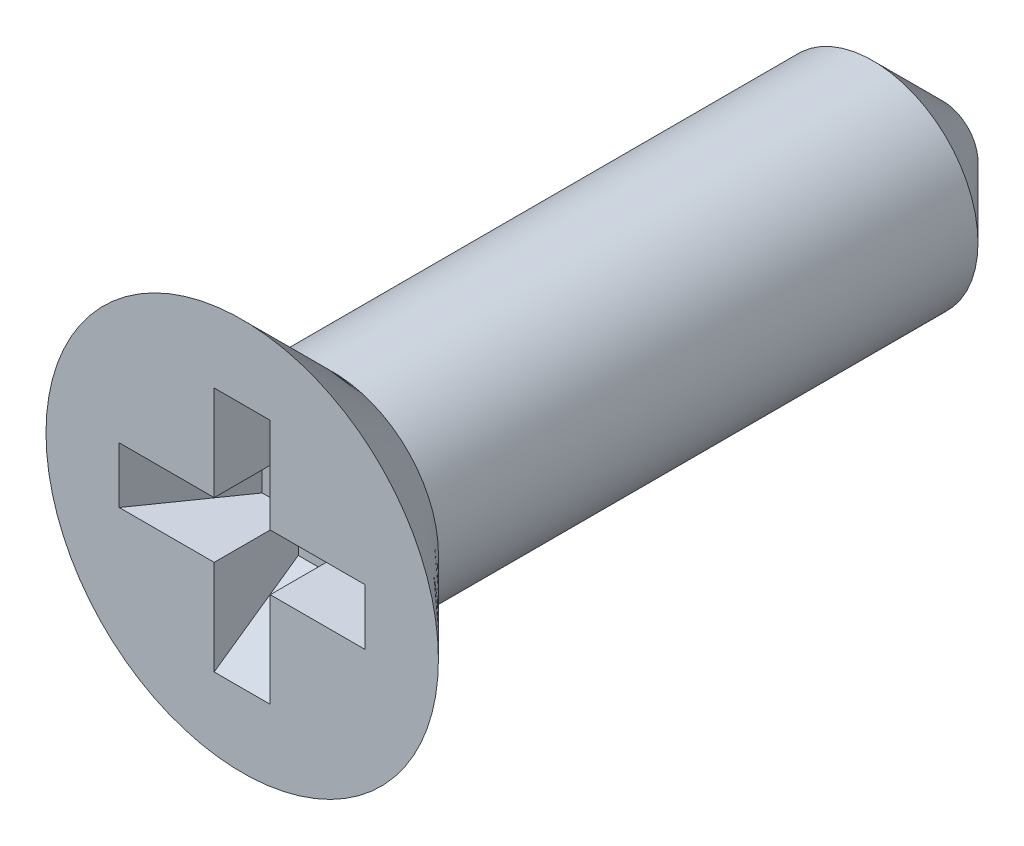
ISO-10303-21;
HEADER;
FILE_DESCRIPTION(('STEP AP214'),'2;1');
FILE_NAME('part.step','',(''),(''),'','','');
FILE_SCHEMA(('AUTOMOTIVE_DESIGN { 1 0 10303 214 1 1 1 1 }'));
ENDSEC;
DATA;
#1=APPLICATION_CONTEXT('core data for automotive mechanical design processes');
#2=APPLICATION_PROTOCOL_DEFINITION('international standard','automotive_design',2000,#1);
#3=PRODUCT_CONTEXT('',#1,'mechanical');
#4=PRODUCT('Part','Part','',(#3));
#5=PRODUCT_RELATED_PRODUCT_CATEGORY('part','',(#4));
#6=PRODUCT_DEFINITION_FORMATION('','',#4);
#7=PRODUCT_DEFINITION_CONTEXT('part definition',#1,'design');
#8=PRODUCT_DEFINITION('design','',#6,#7);
#9=PRODUCT_DEFINITION_SHAPE('','',#8);
#10=(LENGTH_UNIT() NAMED_UNIT(*) SI_UNIT(.MILLI.,.METRE.));
#11=(NAMED_UNIT(*) PLANE_ANGLE_UNIT() SI_UNIT($,.RADIAN.));
#12=(NAMED_UNIT(*) SI_UNIT($,.STERADIAN.) SOLID_ANGLE_UNIT());
#13=UNCERTAINTY_MEASURE_WITH_UNIT(LENGTH_MEASURE(1.E-05),#10,'distance_accuracy_value','');
#14=(GEOMETRIC_REPRESENTATION_CONTEXT(3) GLOBAL_UNCERTAINTY_ASSIGNED_CONTEXT((#13)) GLOBAL_UNIT_ASSIGNED_CONTEXT((#10,
#11,#12)) REPRESENTATION_CONTEXT('',''));
#15=CARTESIAN_POINT('',(0.,0.,0.));
#16=DIRECTION('',(0.,0.,1.));
#17=DIRECTION('',(1.,0.,0.));
#18=AXIS2_PLACEMENT_3D('',#15,#16,#17);
#19=CARTESIAN_POINT('',(-1.75499287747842,-0.4,0.));
#20=DIRECTION('',(0.819152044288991,0.,0.573576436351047));
#21=DIRECTION('',(0.573576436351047,0.,-0.819152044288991));
#22=AXIS2_PLACEMENT_3D('',#19,#20,#21);
#23=PLANE('',#22);
#24=DIRECTION('',(0.,1.,0.));
#25=VECTOR('',#24,1.);
#26=CARTESIAN_POINT('',(0.,0.4,-2.50638957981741));
#27=LINE('',#26,#25);
#28=CARTESIAN_POINT('',(0.,-0.29361042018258,-2.50638957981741));
#29=VERTEX_POINT('',#28);
#30=CARTESIAN_POINT('',(0.,0.,-2.50638957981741));
#31=VERTEX_POINT('',#30);
#32=EDGE_CURVE('E354',#29,#31,#27,.T.);
#33=ORIENTED_EDGE('',*,*,#32,.F.);
#34=CARTESIAN_POINT('',(0.103438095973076,-0.102874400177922,-2.65411449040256));
#35=CARTESIAN_POINT('',(0.09992365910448,-0.113485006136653,-2.64909535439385));
#36=CARTESIAN_POINT('',(0.096077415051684,-0.123726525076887,-2.64360234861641));
#37=CARTESIAN_POINT('',(0.0878958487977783,-0.143557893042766,-2.63191786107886));
#38=CARTESIAN_POINT('',(0.0835619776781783,-0.153149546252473,-2.62572845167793));
#39=CARTESIAN_POINT('',(0.0745900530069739,-0.171760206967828,-2.61291521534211));
#40=CARTESIAN_POINT('',(0.0699544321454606,-0.180782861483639,-2.60629486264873));
#41=CARTESIAN_POINT('',(0.0604348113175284,-0.198432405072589,-2.59269943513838));
#42=CARTESIAN_POINT('',(0.0555506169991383,-0.207058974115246,-2.58572408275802));
#43=CARTESIAN_POINT('',(0.0425194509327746,-0.229237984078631,-2.56711364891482));
#44=CARTESIAN_POINT('',(0.0342270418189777,-0.242528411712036,-2.55527086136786));
#45=CARTESIAN_POINT('',(0.0172728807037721,-0.268554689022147,-2.5310578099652));
#46=CARTESIAN_POINT('',(0.00860925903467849,-0.28128685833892,-2.51868487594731));
#47=CARTESIAN_POINT('',(-0.000140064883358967,-0.2938104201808,-2.50618954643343));
#48=B_SPLINE_CURVE_WITH_KNOTS('',3,(#34,#35,#36,#37,#38,#39,#40,#41,#42,#43,#44,#45,#46,#47),
.UNSPECIFIED.,.F.,.F.,(4,2,2,2,2,2,4),(0.,0.036695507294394,0.0732845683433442,
0.109608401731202,0.145961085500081,0.204852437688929,0.264086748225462),.UNSPECIFIED.);
#49=CARTESIAN_POINT('',(0.103298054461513,-0.103298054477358,-2.65391449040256));
#50=VERTEX_POINT('',#49);
#51=EDGE_CURVE('E289',#50,#29,#48,.T.);
#52=ORIENTED_EDGE('',*,*,#51,.F.);
#53=DIRECTION('',(-0.497542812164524,0.497542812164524,0.710564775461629));
#54=VECTOR('',#53,1.);
#55=CARTESIAN_POINT('',(-1.41956594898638,1.41956594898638,-0.479039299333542));
#56=LINE('',#55,#54);
#57=EDGE_CURVE('E352',#50,#31,#56,.T.);
#58=ORIENTED_EDGE('',*,*,#57,.T.);
#59=EDGE_LOOP('',(#33,#52,#58));
#60=FACE_BOUND('',#59,.T.);
#61=ADVANCED_FACE('F27',(#60),#23,.T.);
#62=DIRECTION('',(0.,1.,0.));
#63=VECTOR('',#62,1.);
#64=CARTESIAN_POINT('',(-0.91474383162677,-0.4,-1.2));
#65=LINE('',#64,#63);
#66=CARTESIAN_POINT('',(-0.91474383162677,0.4,-1.2));
#67=VERTEX_POINT('',#66);
#68=CARTESIAN_POINT('',(-0.91474383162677,-0.4,-1.2));
#69=VERTEX_POINT('',#68);
#70=EDGE_CURVE('E348',#67,#69,#65,.F.);
#71=ORIENTED_EDGE('',*,*,#70,.F.);
#72=DIRECTION('',(0.573576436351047,0.,-0.819152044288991));
#73=VECTOR('',#72,1.);
#74=CARTESIAN_POINT('',(-1.19117730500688,0.4,-0.8052120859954));
#75=LINE('',#74,#73);
#76=CARTESIAN_POINT('',(-1.75499287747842,0.4,0.));
#77=VERTEX_POINT('',#76);
#78=EDGE_CURVE('E232',#67,#77,#75,.F.);
#79=ORIENTED_EDGE('',*,*,#78,.T.);
#80=DIRECTION('',(0.,-1.,0.));
#81=VECTOR('',#80,1.);
#82=CARTESIAN_POINT('',(-1.75499287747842,-0.4,0.));
#83=LINE('',#82,#81);
#84=CARTESIAN_POINT('',(-1.75499287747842,-0.4,0.));
#85=VERTEX_POINT('',#84);
#86=EDGE_CURVE('E173',#77,#85,#83,.T.);
#87=ORIENTED_EDGE('',*,*,#86,.T.);
#88=DIRECTION('',(0.573576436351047,0.,-0.819152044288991));
#89=VECTOR('',#88,1.);
#90=CARTESIAN_POINT('',(-1.75499287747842,-0.4,0.));
#91=LINE('',#90,#89);
#92=EDGE_CURVE('E164',#69,#85,#91,.F.);
#93=ORIENTED_EDGE('',*,*,#92,.F.);
#94=EDGE_LOOP('',(#71,#79,#87,#93));
#95=FACE_BOUND('',#94,.T.);
#96=ADVANCED_FACE('F283',(#95),#23,.T.);
#97=CARTESIAN_POINT('',(0.4,-1.75499287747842,0.));
#98=DIRECTION('',(0.,0.819152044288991,0.573576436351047));
#99=DIRECTION('',(0.,-0.573576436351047,0.819152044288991));
#100=AXIS2_PLACEMENT_3D('',#97,#98,#99);
#101=PLANE('',#100);
#102=DIRECTION('',(-1.,0.,0.));
#103=VECTOR('',#102,1.);
#104=CARTESIAN_POINT('',(0.4,-0.91474383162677,-1.2));
#105=LINE('',#104,#103);
#106=CARTESIAN_POINT('',(-0.4,-0.91474383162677,-1.2));
#107=VERTEX_POINT('',#106);
#108=CARTESIAN_POINT('',(0.4,-0.91474383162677,-1.2));
#109=VERTEX_POINT('',#108);
#110=EDGE_CURVE('E346',#107,#109,#105,.F.);
#111=ORIENTED_EDGE('',*,*,#110,.F.);
#112=DIRECTION('',(0.,0.573576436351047,-0.819152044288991));
#113=VECTOR('',#112,1.);
#114=CARTESIAN_POINT('',(-0.4,-0.74539829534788,-1.44185049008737));
#115=LINE('',#114,#113);
#116=CARTESIAN_POINT('',(-0.4,-1.75499287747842,0.));
#117=VERTEX_POINT('',#116);
#118=EDGE_CURVE('E163',#107,#117,#115,.F.);
#119=ORIENTED_EDGE('',*,*,#118,.T.);
#120=DIRECTION('',(1.,0.,0.));
#121=VECTOR('',#120,1.);
#122=CARTESIAN_POINT('',(0.4,-1.75499287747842,0.));
#123=LINE('',#122,#121);
#124=CARTESIAN_POINT('',(0.4,-1.75499287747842,0.));
#125=VERTEX_POINT('',#124);
#126=EDGE_CURVE('E179',#117,#125,#123,.T.);
#127=ORIENTED_EDGE('',*,*,#126,.T.);
#128=DIRECTION('',(0.,0.573576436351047,-0.819152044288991));
#129=VECTOR('',#128,1.);
#130=CARTESIAN_POINT('',(0.4,-1.75499287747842,0.));
#131=LINE('',#130,#129);
#132=EDGE_CURVE('E240',#109,#125,#131,.F.);
#133=ORIENTED_EDGE('',*,*,#132,.F.);
#134=EDGE_LOOP('',(#111,#119,#127,#133));
#135=FACE_BOUND('',#134,.T.);
#136=ADVANCED_FACE('F279',(#135),#101,.T.);
#137=CARTESIAN_POINT('',(-1.75499287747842,1.75499287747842,-1.2));
#138=DIRECTION('',(0.,0.,-1.));
#139=DIRECTION('',(-1.,0.,0.));
#140=AXIS2_PLACEMENT_3D('',#137,#138,#139);
#141=PLANE('',#140);
#142=DIRECTION('',(0.,-1.,0.));
#143=VECTOR('',#142,1.);
#144=CARTESIAN_POINT('',(-0.4,1.75499287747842,-1.2));
#145=LINE('',#144,#143);
#146=CARTESIAN_POINT('',(-0.4,1.54919333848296,-1.2));
#147=VERTEX_POINT('',#146);
#148=CARTESIAN_POINT('',(-0.4,0.91474383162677,-1.2));
#149=VERTEX_POINT('',#148);
#150=EDGE_CURVE('E223',#147,#149,#145,.T.);
#151=ORIENTED_EDGE('',*,*,#150,.T.);
#152=CARTESIAN_POINT('',(-0.4,0.4,-1.2));
#153=VERTEX_POINT('',#152);
#154=EDGE_CURVE('E224',#149,#153,#145,.T.);
#155=ORIENTED_EDGE('',*,*,#154,.T.);
#156=DIRECTION('',(-1.,0.,0.));
#157=VECTOR('',#156,1.);
#158=CARTESIAN_POINT('',(-1.75499287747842,0.4,-1.2));
#159=LINE('',#158,#157);
#160=EDGE_CURVE('E227',#153,#67,#159,.T.);
#161=ORIENTED_EDGE('',*,*,#160,.T.);
#162=ORIENTED_EDGE('',*,*,#70,.T.);
#163=DIRECTION('',(1.,0.,0.));
#164=VECTOR('',#163,1.);
#165=CARTESIAN_POINT('',(-1.75499287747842,-0.4,-1.2));
#166=LINE('',#165,#164);
#167=CARTESIAN_POINT('',(-0.4,-0.4,-1.2));
#168=VERTEX_POINT('',#167);
#169=EDGE_CURVE('E208',#69,#168,#166,.T.);
#170=ORIENTED_EDGE('',*,*,#169,.T.);
#171=DIRECTION('',(0.,-1.,0.));
#172=VECTOR('',#171,1.);
#173=CARTESIAN_POINT('',(-0.4,-0.4,-1.2));
#174=LINE('',#173,#172);
#175=EDGE_CURVE('E159',#168,#107,#174,.T.);
#176=ORIENTED_EDGE('',*,*,#175,.T.);
#177=ORIENTED_EDGE('',*,*,#110,.T.);
#178=DIRECTION('',(0.,1.,0.));
#179=VECTOR('',#178,1.);
#180=CARTESIAN_POINT('',(0.4,-0.4,-1.2));
#181=LINE('',#180,#179);
#182=CARTESIAN_POINT('',(0.4,-0.4,-1.2));
#183=VERTEX_POINT('',#182);
#184=EDGE_CURVE('E211',#109,#183,#181,.T.);
#185=ORIENTED_EDGE('',*,*,#184,.T.);
#186=DIRECTION('',(1.,0.,0.));
#187=VECTOR('',#186,1.);
#188=CARTESIAN_POINT('',(0.4,-0.4,-1.2));
#189=LINE('',#188,#187);
#190=CARTESIAN_POINT('',(0.91474383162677,-0.4,-1.2));
#191=VERTEX_POINT('',#190);
#192=EDGE_CURVE('E214',#183,#191,#189,.T.);
#193=ORIENTED_EDGE('',*,*,#192,.T.);
#194=DIRECTION('',(0.,-1.,0.));
#195=VECTOR('',#194,1.);
#196=CARTESIAN_POINT('',(0.91474383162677,0.4,-1.2));
#197=LINE('',#196,#195);
#198=CARTESIAN_POINT('',(0.91474383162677,0.4,-1.2));
#199=VERTEX_POINT('',#198);
#200=EDGE_CURVE('E339',#191,#199,#197,.F.);
#201=ORIENTED_EDGE('',*,*,#200,.T.);
#202=DIRECTION('',(-1.,0.,0.));
#203=VECTOR('',#202,1.);
#204=CARTESIAN_POINT('',(0.4,0.4,-1.2));
#205=LINE('',#204,#203);
#206=CARTESIAN_POINT('',(0.4,0.4,-1.2));
#207=VERTEX_POINT('',#206);
#208=EDGE_CURVE('E217',#199,#207,#205,.T.);
#209=ORIENTED_EDGE('',*,*,#208,.T.);
#210=DIRECTION('',(0.,1.,0.));
#211=VECTOR('',#210,1.);
#212=CARTESIAN_POINT('',(0.4,1.75499287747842,-1.2));
#213=LINE('',#212,#211);
#214=CARTESIAN_POINT('',(0.4,0.91474383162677,-1.2));
#215=VERTEX_POINT('',#214);
#216=EDGE_CURVE('E220',#207,#215,#213,.T.);
#217=ORIENTED_EDGE('',*,*,#216,.T.);
#218=CARTESIAN_POINT('',(0.4,1.54919333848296,-1.2));
#219=VERTEX_POINT('',#218);
#220=EDGE_CURVE('E221',#215,#219,#213,.T.);
#221=ORIENTED_EDGE('',*,*,#220,.T.);
#222=CARTESIAN_POINT('',(0.,0.,-1.2));
#223=DIRECTION('',(0.,0.,-1.));
#224=DIRECTION('',(-1.,0.,0.));
#225=AXIS2_PLACEMENT_3D('',#222,#223,#224);
#226=CIRCLE('',#225,1.6);
#227=EDGE_CURVE('E249',#147,#219,#226,.T.);
#228=ORIENTED_EDGE('',*,*,#227,.F.);
#229=EDGE_LOOP('',(#151,#155,#161,#162,#170,#176,#177,#185,#193,#201,#209,#217,#221,#228));
#230=FACE_BOUND('',#229,.T.);
#231=ADVANCED_FACE('F282',(#230),#141,.F.);
#232=CARTESIAN_POINT('',(1.75499287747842,0.4,0.));
#233=DIRECTION('',(-0.819152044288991,0.,0.573576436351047));
#234=DIRECTION('',(0.573576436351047,0.,0.819152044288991));
#235=AXIS2_PLACEMENT_3D('',#232,#233,#234);
#236=PLANE('',#235);
#237=ORIENTED_EDGE('',*,*,#200,.F.);
#238=DIRECTION('',(-0.573576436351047,0.,-0.819152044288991));
#239=VECTOR('',#238,1.);
#240=CARTESIAN_POINT('',(0.74539829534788,-0.4,-1.44185049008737));
#241=LINE('',#240,#239);
#242=CARTESIAN_POINT('',(1.75499287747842,-0.4,0.));
#243=VERTEX_POINT('',#242);
#244=EDGE_CURVE('E239',#191,#243,#241,.F.);
#245=ORIENTED_EDGE('',*,*,#244,.T.);
#246=DIRECTION('',(0.,1.,0.));
#247=VECTOR('',#246,1.);
#248=CARTESIAN_POINT('',(1.75499287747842,0.4,0.));
#249=LINE('',#248,#247);
#250=CARTESIAN_POINT('',(1.75499287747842,0.4,0.));
#251=VERTEX_POINT('',#250);
#252=EDGE_CURVE('E190',#243,#251,#249,.T.);
#253=ORIENTED_EDGE('',*,*,#252,.T.);
#254=DIRECTION('',(-0.573576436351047,0.,-0.819152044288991));
#255=VECTOR('',#254,1.);
#256=CARTESIAN_POINT('',(1.75499287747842,0.4,0.));
#257=LINE('',#256,#255);
#258=EDGE_CURVE('E237',#199,#251,#257,.F.);
#259=ORIENTED_EDGE('',*,*,#258,.F.);
#260=EDGE_LOOP('',(#237,#245,#253,#259));
#261=FACE_BOUND('',#260,.T.);
#262=ADVANCED_FACE('F318',(#261),#236,.T.);
#263=CARTESIAN_POINT('',(-0.4,1.75499287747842,-1.2));
#264=DIRECTION('',(-1.,0.,0.));
#265=DIRECTION('',(0.,-1.,0.));
#266=AXIS2_PLACEMENT_3D('',#263,#264,#265);
#267=PLANE('',#266);
#268=DIRECTION('',(0.,-0.573576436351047,-0.819152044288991));
#269=VECTOR('',#268,1.);
#270=CARTESIAN_POINT('',(-0.4,1.75499287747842,0.));
#271=LINE('',#270,#269);
#272=CARTESIAN_POINT('',(-0.399999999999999,0.0800481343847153,-2.39206899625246));
#273=VERTEX_POINT('',#272);
#274=EDGE_CURVE('E233',#273,#149,#271,.F.);
#275=ORIENTED_EDGE('',*,*,#274,.T.);
#276=ORIENTED_EDGE('',*,*,#150,.F.);
#277=CARTESIAN_POINT('',(-0.399999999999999,15.0579581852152,12.2632700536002));
#278=CARTESIAN_POINT('',(-0.399999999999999,14.5558054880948,11.7612956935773));
#279=CARTESIAN_POINT('',(-0.399999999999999,14.0536451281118,11.2593289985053));
#280=CARTESIAN_POINT('',(-0.399999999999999,13.0492997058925,10.2554201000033));
#281=CARTESIAN_POINT('',(-0.399999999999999,12.5471146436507,9.75347789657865));
#282=CARTESIAN_POINT('',(-0.4,11.5427035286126,8.74962023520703));
#283=CARTESIAN_POINT('',(-0.4,11.0404774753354,8.24770477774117));
#284=CARTESIAN_POINT('',(-0.4,10.035974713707,7.24392476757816));
#285=CARTESIAN_POINT('',(-0.4,9.53369800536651,6.74206021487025));
#286=CARTESIAN_POINT('',(-0.4,8.53379190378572,5.74313239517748));
#287=CARTESIAN_POINT('',(-0.4,8.03616325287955,5.24606838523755));
#288=CARTESIAN_POINT('',(-0.4,7.04077073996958,4.25207516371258));
#289=CARTESIAN_POINT('',(-0.4,6.54300687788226,3.75514595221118));
#290=CARTESIAN_POINT('',(-0.4,5.54723950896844,2.76153914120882));
#291=CARTESIAN_POINT('',(-0.4,5.04923600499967,2.26486153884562));
#292=CARTESIAN_POINT('',(-0.4,4.30178667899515,1.52029138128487));
#293=CARTESIAN_POINT('',(-0.4,4.05256301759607,1.27217582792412));
#294=CARTESIAN_POINT('',(-0.4,3.55386033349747,0.776201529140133));
#295=CARTESIAN_POINT('',(-0.4,3.30438131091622,0.528342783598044));
#296=CARTESIAN_POINT('',(-0.4,2.93753545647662,0.164606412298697));
#297=CARTESIAN_POINT('',(-0.4,2.82036145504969,0.0485343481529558));
#298=CARTESIAN_POINT('',(-0.4,2.58585174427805,-0.183450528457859));
#299=CARTESIAN_POINT('',(-0.4,2.46851603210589,-0.299363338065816));
#300=CARTESIAN_POINT('',(-0.4,2.23338081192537,-0.531167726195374));
#301=CARTESIAN_POINT('',(-0.4,2.11558084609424,-0.647058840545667));
#302=CARTESIAN_POINT('',(-0.4,1.8796050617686,-0.878446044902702));
#303=CARTESIAN_POINT('',(-0.4,1.76142926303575,-0.993942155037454));
#304=CARTESIAN_POINT('',(-0.4,1.56017330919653,-1.18948487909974));
#305=CARTESIAN_POINT('',(-0.4,1.47726626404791,-1.26970931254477));
#306=CARTESIAN_POINT('',(-0.4,1.3109062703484,-1.42961730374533));
#307=CARTESIAN_POINT('',(-0.4,1.22745323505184,-1.5093007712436));
#308=CARTESIAN_POINT('',(-0.4,1.05990662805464,-1.66747507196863));
#309=CARTESIAN_POINT('',(-0.4,0.975815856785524,-1.74596884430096));
#310=CARTESIAN_POINT('',(-0.4,0.848350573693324,-1.8622334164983));
#311=CARTESIAN_POINT('',(-0.4,0.805646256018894,-1.9007373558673));
#312=CARTESIAN_POINT('',(-0.4,0.719561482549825,-1.97697966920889));
#313=CARTESIAN_POINT('',(-0.4,0.676181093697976,-2.01471811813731));
#314=CARTESIAN_POINT('',(-0.4,0.592876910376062,-2.08511456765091));
#315=CARTESIAN_POINT('',(-0.4,0.553057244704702,-2.11789551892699));
#316=CARTESIAN_POINT('',(-0.4,0.471811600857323,-2.18196758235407));
#317=CARTESIAN_POINT('',(-0.4,0.430377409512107,-2.21324856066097));
#318=CARTESIAN_POINT('',(-0.4,0.366190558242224,-2.25791062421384));
#319=CARTESIAN_POINT('',(-0.4,0.344296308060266,-2.27251479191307));
#320=CARTESIAN_POINT('',(-0.4,0.299692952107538,-2.30048853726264));
#321=CARTESIAN_POINT('',(-0.4,0.276983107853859,-2.31385695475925));
#322=CARTESIAN_POINT('',(-0.4,0.230746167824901,-2.33862577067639));
#323=CARTESIAN_POINT('',(-0.4,0.207227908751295,-2.35004229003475));
#324=CARTESIAN_POINT('',(-0.4,0.159057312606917,-2.37009132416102));
#325=CARTESIAN_POINT('',(-0.4,0.134407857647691,-2.37873050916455));
#326=CARTESIAN_POINT('',(-0.4,0.0836001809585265,-2.3920966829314));
#327=CARTESIAN_POINT('',(-0.4,0.0574247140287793,-2.39676217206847));
#328=CARTESIAN_POINT('',(-0.4,0.0047203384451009,-2.4008277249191));
#329=CARTESIAN_POINT('',(-0.4,-0.0218072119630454,-2.40024417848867));
#330=CARTESIAN_POINT('',(-0.4,-0.0740664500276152,-2.394031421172));
#331=CARTESIAN_POINT('',(-0.4,-0.0998019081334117,-2.38843198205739));
#332=CARTESIAN_POINT('',(-0.4,-0.137559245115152,-2.37718134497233));
#333=CARTESIAN_POINT('',(-0.4,-0.150037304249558,-2.37294020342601));
#334=CARTESIAN_POINT('',(-0.4,-0.174694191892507,-2.36366501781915));
#335=CARTESIAN_POINT('',(-0.4,-0.186873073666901,-2.35863111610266));
#336=CARTESIAN_POINT('',(-0.4,-0.221460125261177,-2.34323447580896));
#337=CARTESIAN_POINT('',(-0.4,-0.243504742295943,-2.33205986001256));
#338=CARTESIAN_POINT('',(-0.4,-0.28674808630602,-2.30816513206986));
#339=CARTESIAN_POINT('',(-0.4,-0.307945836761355,-2.2954433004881));
#340=CARTESIAN_POINT('',(-0.4,-0.370676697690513,-2.25562796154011));
#341=CARTESIAN_POINT('',(-0.4,-0.411199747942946,-2.22695881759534));
#342=CARTESIAN_POINT('',(-0.4,-0.491046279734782,-2.16720199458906));
#343=CARTESIAN_POINT('',(-0.4,-0.530352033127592,-2.13609149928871));
#344=CARTESIAN_POINT('',(-0.4,-0.607844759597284,-2.07268891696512));
#345=CARTESIAN_POINT('',(-0.4,-0.646034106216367,-2.04039972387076));
#346=CARTESIAN_POINT('',(-0.4,-0.720929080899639,-1.97574798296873));
#347=CARTESIAN_POINT('',(-0.4,-0.757648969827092,-1.94340180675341));
#348=CARTESIAN_POINT('',(-0.4,-0.830642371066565,-1.8782086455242));
#349=CARTESIAN_POINT('',(-0.4,-0.866915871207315,-1.84536164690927));
#350=CARTESIAN_POINT('',(-0.4,-0.97527461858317,-1.74629556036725));
#351=CARTESIAN_POINT('',(-0.4,-1.04688735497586,-1.67956084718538));
#352=CARTESIAN_POINT('',(-0.4,-1.1894988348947,-1.54527111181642));
#353=CARTESIAN_POINT('',(-0.4,-1.26049672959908,-1.47771519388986));
#354=CARTESIAN_POINT('',(-0.4,-1.40204788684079,-1.34215102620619));
#355=CARTESIAN_POINT('',(-0.4,-1.47260118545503,-1.27414281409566));
#356=CARTESIAN_POINT('',(-0.4,-1.61263010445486,-1.1385931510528));
#357=CARTESIAN_POINT('',(-0.4,-1.68210893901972,-1.07105501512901));
#358=CARTESIAN_POINT('',(-0.4,-1.82087103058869,-0.935775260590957));
#359=CARTESIAN_POINT('',(-0.4,-1.89015428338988,-0.868033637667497));
#360=CARTESIAN_POINT('',(-0.4,-2.09772182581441,-0.664662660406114));
#361=CARTESIAN_POINT('',(-0.4,-2.23579508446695,-0.528818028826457));
#362=CARTESIAN_POINT('',(-0.4,-2.64691525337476,-0.123422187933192));
#363=CARTESIAN_POINT('',(-0.4,-2.9195143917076,0.146582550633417));
#364=CARTESIAN_POINT('',(-0.4,-3.46422315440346,0.687087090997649));
#365=CARTESIAN_POINT('',(-0.4,-3.73633277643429,0.957586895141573));
#366=CARTESIAN_POINT('',(-0.4,-4.28035165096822,1.4989153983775));
#367=CARTESIAN_POINT('',(-0.4,-4.55226084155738,1.76974415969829));
#368=CARTESIAN_POINT('',(-0.4,-5.09592685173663,2.31155357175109));
#369=CARTESIAN_POINT('',(-0.4,-5.3676836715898,2.58253422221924));
#370=CARTESIAN_POINT('',(-0.4,-6.19795427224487,3.41071951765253));
#371=CARTESIAN_POINT('',(-0.4,-6.75631703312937,3.96807555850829));
#372=CARTESIAN_POINT('',(-0.4,-7.59365945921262,4.80417361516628));
#373=CARTESIAN_POINT('',(-0.4,-7.87270550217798,5.08284918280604));
#374=CARTESIAN_POINT('',(-0.4,-8.43076267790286,5.64023492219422));
#375=CARTESIAN_POINT('',(-0.4,-8.70977381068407,5.91894509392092));
#376=CARTESIAN_POINT('',(-0.4,-8.98877231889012,6.19766790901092));
#377=B_SPLINE_CURVE_WITH_KNOTS('',3,(#277,#278,#279,#280,#281,#282,#283,#284,#285,#286,#287,
#288,#289,#290,#291,#292,#293,#294,#295,#296,#297,#298,#299,#300,#301,#302,#303,#304,#305,#306,
#307,#308,#309,#310,#311,#312,#313,#314,#315,#316,#317,#318,#319,#320,#321,#322,#323,#324,#325,
#326,#327,#328,#329,#330,#331,#332,#333,#334,#335,#336,#337,#338,#339,#340,#341,#342,#343,#344,
#345,#346,#347,#348,#349,#350,#351,#352,#353,#354,#355,#356,#357,#358,#359,#360,#361,#362,#363,
#364,#365,#366,#367,#368,#369,#370,#371,#372,#373,#374,#375,#376),.UNSPECIFIED.,.F.,.F.,(4,2,2,
2,2,2,2,2,2,2,2,2,2,2,2,2,2,2,2,2,2,2,2,2,2,2,2,2,2,2,2,2,2,2,2,2,2,2,2,2,2,2,2,2,2,2,2,2,2,4),
(0.,2.13007518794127,4.26015084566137,6.39025675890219,8.5203622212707,10.630424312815,
12.7404877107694,14.8505265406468,15.905544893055,16.9605627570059,17.4553578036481,
17.9501616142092,18.4459113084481,18.9416353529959,19.2877342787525,19.6338895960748,
19.9789680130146,20.1514624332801,20.3239398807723,20.4786541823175,20.6342979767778,
20.7132243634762,20.7922241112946,20.8705360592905,20.9486584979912,21.0279691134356,
21.1070321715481,21.1856290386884,21.2251461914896,21.2646562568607,21.3387009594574,
21.412828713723,21.5615772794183,21.7119356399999,21.8619468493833,22.0087463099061,
22.1555497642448,22.4491996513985,22.7432052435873,23.0371866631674,23.3278722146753,
23.6185639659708,24.1996497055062,25.3506976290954,26.5017510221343,27.6530742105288,
28.8043954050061,31.1711932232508,32.3542996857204,33.5374054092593),.UNSPECIFIED.);
#378=CARTESIAN_POINT('',(-0.4,1.4456832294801,-1.3));
#379=VERTEX_POINT('',#378);
#380=EDGE_CURVE('E266',#379,#147,#377,.F.);
#381=ORIENTED_EDGE('',*,*,#380,.F.);
#382=EDGE_CURVE('E333',#273,#379,#377,.F.);
#383=ORIENTED_EDGE('',*,*,#382,.F.);
#384=EDGE_LOOP('',(#275,#276,#381,#383));
#385=FACE_BOUND('',#384,.T.);
#386=ADVANCED_FACE('F329',(#385),#267,.T.);
#387=CARTESIAN_POINT('',(0.4,1.75499287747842,-1.2));
#388=DIRECTION('',(1.,0.,0.));
#389=DIRECTION('',(0.,0.,-1.));
#390=AXIS2_PLACEMENT_3D('',#387,#388,#389);
#391=PLANE('',#390);
#392=ORIENTED_EDGE('',*,*,#220,.F.);
#393=DIRECTION('',(0.,-0.573576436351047,-0.819152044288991));
#394=VECTOR('',#393,1.);
#395=CARTESIAN_POINT('',(0.4,1.19117730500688,-0.8052120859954));
#396=LINE('',#395,#394);
#397=CARTESIAN_POINT('',(0.4,0.080048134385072,-2.39206899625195));
#398=VERTEX_POINT('',#397);
#399=EDGE_CURVE('E236',#398,#215,#396,.F.);
#400=ORIENTED_EDGE('',*,*,#399,.F.);
#401=CARTESIAN_POINT('',(0.4,-8.98877231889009,6.19766790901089));
#402=CARTESIAN_POINT('',(0.4,-8.67677785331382,5.88598452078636));
#403=CARTESIAN_POINT('',(0.4,-8.36476980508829,5.57431472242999));
#404=CARTESIAN_POINT('',(0.4,-7.74070720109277,4.95101906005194));
#405=CARTESIAN_POINT('',(0.4,-7.42865264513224,4.63939319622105));
#406=CARTESIAN_POINT('',(0.4,-6.80445030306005,4.01617482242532));
#407=CARTESIAN_POINT('',(0.4,-6.49230251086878,3.70458231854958));
#408=CARTESIAN_POINT('',(0.4,-5.86791216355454,3.08149481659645));
#409=CARTESIAN_POINT('',(0.4,-5.55566960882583,2.76999981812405));
#410=CARTESIAN_POINT('',(0.4,-4.93358205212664,2.14971502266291));
#411=CARTESIAN_POINT('',(0.4,-4.6237383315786,1.84092394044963));
#412=CARTESIAN_POINT('',(0.4,-4.00378028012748,1.22360590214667));
#413=CARTESIAN_POINT('',(0.4,-3.69366594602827,0.915078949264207));
#414=CARTESIAN_POINT('',(0.4,-3.2280826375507,0.452721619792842));
#415=CARTESIAN_POINT('',(0.4,-3.07282418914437,0.298679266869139));
#416=CARTESIAN_POINT('',(0.4,-2.76208514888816,-0.00918294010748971));
#417=CARTESIAN_POINT('',(0.4,-2.60660455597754,-0.163002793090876));
#418=CARTESIAN_POINT('',(0.4,-2.2952766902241,-0.47026389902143));
#419=CARTESIAN_POINT('',(0.4,-2.13942942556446,-0.623705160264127));
#420=CARTESIAN_POINT('',(0.4,-1.82707739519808,-0.929916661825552));
#421=CARTESIAN_POINT('',(0.4,-1.67057263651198,-1.08268690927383));
#422=CARTESIAN_POINT('',(0.4,-1.4712876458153,-1.27534266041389));
#423=CARTESIAN_POINT('',(0.4,-1.42919052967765,-1.31593419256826));
#424=CARTESIAN_POINT('',(0.4,-1.34485413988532,-1.39696971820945));
#425=CARTESIAN_POINT('',(0.4,-1.30261486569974,-1.43741371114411));
#426=CARTESIAN_POINT('',(0.4,-1.21790078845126,-1.51815834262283));
#427=CARTESIAN_POINT('',(0.4,-1.17542576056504,-1.5584587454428));
#428=CARTESIAN_POINT('',(0.4,-1.09022739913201,-1.63879610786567));
#429=CARTESIAN_POINT('',(0.4,-1.04750406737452,-1.67883306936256));
#430=CARTESIAN_POINT('',(0.4,-0.946477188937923,-1.77269586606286));
#431=CARTESIAN_POINT('',(0.4,-0.888030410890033,-1.82636758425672));
#432=CARTESIAN_POINT('',(0.4,-0.770250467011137,-1.93246551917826));
#433=CARTESIAN_POINT('',(0.4,-0.710919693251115,-1.98489435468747));
#434=CARTESIAN_POINT('',(0.4,-0.609163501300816,-2.07156587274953));
#435=CARTESIAN_POINT('',(0.4,-0.567230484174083,-2.10638522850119));
#436=CARTESIAN_POINT('',(0.4,-0.481616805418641,-2.17449372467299));
#437=CARTESIAN_POINT('',(0.4,-0.437925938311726,-2.20777040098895));
#438=CARTESIAN_POINT('',(0.4,-0.370106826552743,-2.25527989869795));
#439=CARTESIAN_POINT('',(0.4,-0.346914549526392,-2.2708361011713));
#440=CARTESIAN_POINT('',(0.4,-0.299611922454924,-2.30057434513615));
#441=CARTESIAN_POINT('',(0.4,-0.275500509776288,-2.31475472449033));
#442=CARTESIAN_POINT('',(0.4,-0.226415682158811,-2.34083021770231));
#443=CARTESIAN_POINT('',(0.4,-0.201456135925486,-2.35275078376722));
#444=CARTESIAN_POINT('',(0.4,-0.150247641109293,-2.37335246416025));
#445=CARTESIAN_POINT('',(0.4,-0.124002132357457,-2.3820417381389));
#446=CARTESIAN_POINT('',(0.4,-0.0712736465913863,-2.39447099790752));
#447=CARTESIAN_POINT('',(0.4,-0.0448320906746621,-2.39837555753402));
#448=CARTESIAN_POINT('',(0.4,0.00826983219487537,-2.40078938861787));
#449=CARTESIAN_POINT('',(0.4,0.0349297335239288,-2.39930811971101));
#450=CARTESIAN_POINT('',(0.4,0.0872151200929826,-2.39142094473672));
#451=CARTESIAN_POINT('',(0.4,0.112847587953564,-2.38505800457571));
#452=CARTESIAN_POINT('',(0.4,0.162996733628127,-2.36872094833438));
#453=CARTESIAN_POINT('',(0.4,0.187507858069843,-2.35873067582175));
#454=CARTESIAN_POINT('',(0.4,0.250211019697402,-2.32944881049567));
#455=CARTESIAN_POINT('',(0.4,0.287474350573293,-2.30822859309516));
#456=CARTESIAN_POINT('',(0.4,0.36001468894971,-2.26257652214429));
#457=CARTESIAN_POINT('',(0.4,0.395285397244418,-2.23813521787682));
#458=CARTESIAN_POINT('',(0.4,0.464698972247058,-2.18731247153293));
#459=CARTESIAN_POINT('',(0.4,0.498834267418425,-2.16092076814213));
#460=CARTESIAN_POINT('',(0.4,0.566167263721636,-2.10707763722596));
#461=CARTESIAN_POINT('',(0.4,0.599366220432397,-2.07962775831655));
#462=CARTESIAN_POINT('',(0.4,0.688211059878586,-2.00455725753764));
#463=CARTESIAN_POINT('',(0.4,0.743294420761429,-1.95627354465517));
#464=CARTESIAN_POINT('',(0.4,0.852521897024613,-1.85861308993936));
#465=CARTESIAN_POINT('',(0.4,0.906665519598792,-1.80923580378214));
#466=CARTESIAN_POINT('',(0.4,1.0141200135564,-1.71003906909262));
#467=CARTESIAN_POINT('',(0.4,1.06743344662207,-1.66022239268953));
#468=CARTESIAN_POINT('',(0.4,1.17366653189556,-1.56017068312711));
#469=CARTESIAN_POINT('',(0.4,1.22658617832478,-1.50993564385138));
#470=CARTESIAN_POINT('',(0.4,1.34022302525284,-1.40147670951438));
#471=CARTESIAN_POINT('',(0.4,1.40089527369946,-1.34320575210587));
#472=CARTESIAN_POINT('',(0.4,1.52204643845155,-1.22635067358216));
#473=CARTESIAN_POINT('',(0.4,1.58252512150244,-1.16776631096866));
#474=CARTESIAN_POINT('',(0.4,1.76134257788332,-0.994028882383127));
#475=CARTESIAN_POINT('',(0.4,1.87943072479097,-0.878617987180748));
#476=CARTESIAN_POINT('',(0.4,2.11522557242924,-0.647406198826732));
#477=CARTESIAN_POINT('',(0.4,2.2329322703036,-0.531605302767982));
#478=CARTESIAN_POINT('',(0.4,2.58561472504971,-0.18393263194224));
#479=CARTESIAN_POINT('',(0.4,2.82024009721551,0.0482944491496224));
#480=CARTESIAN_POINT('',(0.4,3.26821543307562,0.492493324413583));
#481=CARTESIAN_POINT('',(0.4,3.48160116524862,0.704429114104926));
#482=CARTESIAN_POINT('',(0.4,3.90816301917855,1.12851207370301));
#483=CARTESIAN_POINT('',(0.4,4.12133914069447,1.34065924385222));
#484=CARTESIAN_POINT('',(0.4,4.76075243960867,1.97736484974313));
#485=CARTESIAN_POINT('',(0.4,5.18680015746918,2.40211347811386));
#486=CARTESIAN_POINT('',(0.4,6.40063874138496,3.61287974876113));
#487=CARTESIAN_POINT('',(0.4,7.18816227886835,4.39916530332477));
#488=CARTESIAN_POINT('',(0.4,8.76295040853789,5.97199608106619));
#489=CARTESIAN_POINT('',(0.4,9.55021500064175,6.75854130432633));
#490=CARTESIAN_POINT('',(0.4,11.1242654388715,8.33141136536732));
#491=CARTESIAN_POINT('',(0.4,11.9110513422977,9.1177361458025));
#492=CARTESIAN_POINT('',(0.4,13.4845477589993,10.6904604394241));
#493=CARTESIAN_POINT('',(0.4,14.2712582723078,11.4768599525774));
#494=CARTESIAN_POINT('',(0.4,15.0579581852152,12.2632700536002));
#495=B_SPLINE_CURVE_WITH_KNOTS('',3,(#401,#402,#403,#404,#405,#406,#407,#408,#409,#410,#411,
#412,#413,#414,#415,#416,#417,#418,#419,#420,#421,#422,#423,#424,#425,#426,#427,#428,#429,#430,
#431,#432,#433,#434,#435,#436,#437,#438,#439,#440,#441,#442,#443,#444,#445,#446,#447,#448,#449,
#450,#451,#452,#453,#454,#455,#456,#457,#458,#459,#460,#461,#462,#463,#464,#465,#466,#467,#468,
#469,#470,#471,#472,#473,#474,#475,#476,#477,#478,#479,#480,#481,#482,#483,#484,#485,#486,#487,
#488,#489,#490,#491,#492,#493,#494),.UNSPECIFIED.,.F.,.F.,(4,2,2,2,2,2,2,2,2,2,2,2,2,2,2,2,2,2,
2,2,2,2,2,2,2,2,2,2,2,2,2,2,2,2,2,2,2,2,2,2,2,2,2,2,2,2,4),(0.,1.3230206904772,2.64604695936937,
3.96920045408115,5.29234851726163,6.60467298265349,7.91701316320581,8.57314423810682,
9.22927845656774,9.88539816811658,10.5415108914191,10.7169488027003,10.8923873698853,
11.0680404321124,11.2436922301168,11.4817424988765,11.7192361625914,11.8827337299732,
12.0473795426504,12.1311266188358,12.2149736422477,12.2978114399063,12.3804386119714,
12.4601358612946,12.5396931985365,12.6185582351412,12.6977789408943,12.8260633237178,
12.9547328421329,13.0841355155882,13.2133555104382,13.4330718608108,13.6529001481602,
13.8717938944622,14.0906908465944,14.3430576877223,14.5956600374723,15.091016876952,
15.5863774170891,16.5767323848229,17.4789808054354,18.3812302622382,20.1860437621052,
23.5245978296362,26.8631529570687,30.2002247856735,33.5372951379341),.UNSPECIFIED.);
#496=CARTESIAN_POINT('',(0.4,1.4456832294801,-1.3));
#497=VERTEX_POINT('',#496);
#498=EDGE_CURVE('E252',#497,#398,#495,.F.);
#499=ORIENTED_EDGE('',*,*,#498,.F.);
#500=EDGE_CURVE('E340',#219,#497,#495,.F.);
#501=ORIENTED_EDGE('',*,*,#500,.F.);
#502=EDGE_LOOP('',(#392,#400,#499,#501));
#503=FACE_BOUND('',#502,.T.);
#504=ADVANCED_FACE('F378',(#503),#391,.T.);
#505=CARTESIAN_POINT('',(0.,0.,-1.3));
#506=DIRECTION('',(0.,0.,1.));
#507=DIRECTION('',(1.,0.,0.));
#508=AXIS2_PLACEMENT_3D('',#505,#506,#507);
#509=CONICAL_SURFACE('',#508,1.5,0.78539816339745);
#510=CARTESIAN_POINT('',(0.,0.,-1.3));
#511=DIRECTION('',(0.,0.,1.));
#512=DIRECTION('',(1.,0.,0.));
#513=AXIS2_PLACEMENT_3D('',#510,#511,#512);
#514=CIRCLE('',#513,1.5);
#515=EDGE_CURVE('E242',#497,#379,#514,.T.);
#516=ORIENTED_EDGE('',*,*,#515,.T.);
#517=ORIENTED_EDGE('',*,*,#380,.T.);
#518=ORIENTED_EDGE('',*,*,#227,.T.);
#519=ORIENTED_EDGE('',*,*,#500,.T.);
#520=EDGE_LOOP('',(#516,#517,#518,#519));
#521=FACE_BOUND('',#520,.T.);
#522=ADVANCED_FACE('F427',(#521),#509,.T.);
#523=CARTESIAN_POINT('',(0.,2.8,0.));
#524=DIRECTION('',(0.,0.,-1.));
#525=DIRECTION('',(-1.,0.,0.));
#526=AXIS2_PLACEMENT_3D('',#523,#524,#525);
#527=PLANE('',#526);
#528=DIRECTION('',(1.,0.,0.));
#529=VECTOR('',#528,1.);
#530=CARTESIAN_POINT('',(-1.75499287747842,-0.4,0.));
#531=LINE('',#530,#529);
#532=CARTESIAN_POINT('',(-0.4,-0.4,0.));
#533=VERTEX_POINT('',#532);
#534=EDGE_CURVE('E167',#85,#533,#531,.T.);
#535=ORIENTED_EDGE('',*,*,#534,.F.);
#536=ORIENTED_EDGE('',*,*,#86,.F.);
#537=DIRECTION('',(-1.,0.,0.));
#538=VECTOR('',#537,1.);
#539=CARTESIAN_POINT('',(-1.75499287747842,0.4,0.));
#540=LINE('',#539,#538);
#541=CARTESIAN_POINT('',(-0.4,0.4,0.));
#542=VERTEX_POINT('',#541);
#543=EDGE_CURVE('E205',#542,#77,#540,.T.);
#544=ORIENTED_EDGE('',*,*,#543,.F.);
#545=DIRECTION('',(0.,-1.,0.));
#546=VECTOR('',#545,1.);
#547=CARTESIAN_POINT('',(-0.4,1.75499287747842,0.));
#548=LINE('',#547,#546);
#549=CARTESIAN_POINT('',(-0.4,1.75499287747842,0.));
#550=VERTEX_POINT('',#549);
#551=EDGE_CURVE('E202',#550,#542,#548,.T.);
#552=ORIENTED_EDGE('',*,*,#551,.F.);
#553=DIRECTION('',(-1.,0.,0.));
#554=VECTOR('',#553,1.);
#555=CARTESIAN_POINT('',(-0.4,1.75499287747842,0.));
#556=LINE('',#555,#554);
#557=CARTESIAN_POINT('',(0.4,1.75499287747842,0.));
#558=VERTEX_POINT('',#557);
#559=EDGE_CURVE('E199',#558,#550,#556,.T.);
#560=ORIENTED_EDGE('',*,*,#559,.F.);
#561=DIRECTION('',(0.,1.,0.));
#562=VECTOR('',#561,1.);
#563=CARTESIAN_POINT('',(0.4,1.75499287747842,0.));
#564=LINE('',#563,#562);
#565=CARTESIAN_POINT('',(0.4,0.4,0.));
#566=VERTEX_POINT('',#565);
#567=EDGE_CURVE('E196',#566,#558,#564,.T.);
#568=ORIENTED_EDGE('',*,*,#567,.F.);
#569=DIRECTION('',(-1.,0.,0.));
#570=VECTOR('',#569,1.);
#571=CARTESIAN_POINT('',(0.4,0.4,0.));
#572=LINE('',#571,#570);
#573=EDGE_CURVE('E193',#251,#566,#572,.T.);
#574=ORIENTED_EDGE('',*,*,#573,.F.);
#575=ORIENTED_EDGE('',*,*,#252,.F.);
#576=DIRECTION('',(1.,0.,0.));
#577=VECTOR('',#576,1.);
#578=CARTESIAN_POINT('',(0.4,-0.4,0.));
#579=LINE('',#578,#577);
#580=CARTESIAN_POINT('',(0.4,-0.4,0.));
#581=VERTEX_POINT('',#580);
#582=EDGE_CURVE('E187',#581,#243,#579,.T.);
#583=ORIENTED_EDGE('',*,*,#582,.F.);
#584=DIRECTION('',(0.,1.,0.));
#585=VECTOR('',#584,1.);
#586=CARTESIAN_POINT('',(0.4,-0.4,0.));
#587=LINE('',#586,#585);
#588=EDGE_CURVE('E181',#125,#581,#587,.T.);
#589=ORIENTED_EDGE('',*,*,#588,.F.);
#590=ORIENTED_EDGE('',*,*,#126,.F.);
#591=DIRECTION('',(0.,-1.,0.));
#592=VECTOR('',#591,1.);
#593=CARTESIAN_POINT('',(-0.4,-0.4,0.));
#594=LINE('',#593,#592);
#595=EDGE_CURVE('E156',#533,#117,#594,.T.);
#596=ORIENTED_EDGE('',*,*,#595,.F.);
#597=EDGE_LOOP('',(#535,#536,#544,#552,#560,#568,#574,#575,#583,#589,#590,#596));
#598=FACE_BOUND('',#597,.T.);
#599=CARTESIAN_POINT('',(0.,0.,0.));
#600=DIRECTION('',(0.,0.,1.));
#601=DIRECTION('',(1.,0.,0.));
#602=AXIS2_PLACEMENT_3D('',#599,#600,#601);
#603=CIRCLE('',#602,2.8);
#604=CARTESIAN_POINT('',(2.8,0.,0.));
#605=VERTEX_POINT('',#604);
#606=EDGE_CURVE('E245',#605,#605,#603,.T.);
#607=ORIENTED_EDGE('',*,*,#606,.T.);
#608=EDGE_LOOP('',(#607));
#609=FACE_BOUND('',#608,.T.);
#610=ADVANCED_FACE('F175',(#598,#609),#527,.F.);
#611=CARTESIAN_POINT('',(0.,0.,-2.79999999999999));
#612=VERTEX_POINT('',#611);
#613=VERTEX_LOOP('',#612);
#614=FACE_BOUND('',#613,.T.);
#615=ORIENTED_EDGE('',*,*,#382,.T.);
#616=EDGE_CURVE('E246',#379,#497,#514,.T.);
#617=ORIENTED_EDGE('',*,*,#616,.T.);
#618=ORIENTED_EDGE('',*,*,#498,.T.);
#619=CARTESIAN_POINT('',(0.400000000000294,0.0800481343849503,-2.39206899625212));
#620=CARTESIAN_POINT('',(0.386959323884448,0.0696774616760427,-2.40687985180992));
#621=CARTESIAN_POINT('',(0.3737879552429,0.0593585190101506,-2.4216168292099));
#622=CARTESIAN_POINT('',(0.347052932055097,0.0388678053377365,-2.45088060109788));
#623=CARTESIAN_POINT('',(0.333488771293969,0.0286962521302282,-2.46540708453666));
#624=CARTESIAN_POINT('',(0.305785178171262,0.00850918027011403,-2.49423721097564));
#625=CARTESIAN_POINT('',(0.291642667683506,-0.00150495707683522,-2.50853888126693));
#626=CARTESIAN_POINT('',(0.2626845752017,-0.0212018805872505,-2.53666900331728));
#627=CARTESIAN_POINT('',(0.247869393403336,-0.0308848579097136,-2.55049772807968));
#628=CARTESIAN_POINT('',(0.219489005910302,-0.0483734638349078,-2.57547404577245));
#629=CARTESIAN_POINT('',(0.206053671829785,-0.0562478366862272,-2.5867198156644));
#630=CARTESIAN_POINT('',(0.178175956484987,-0.0714244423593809,-2.60839425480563));
#631=CARTESIAN_POINT('',(0.163732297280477,-0.0787259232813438,-2.6188218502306));
#632=CARTESIAN_POINT('',(0.135640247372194,-0.0913614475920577,-2.63686724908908));
#633=CARTESIAN_POINT('',(0.122175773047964,-0.0968274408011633,-2.64467349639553));
#634=CARTESIAN_POINT('',(0.0939730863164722,-0.106540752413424,-2.65854554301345));
#635=CARTESIAN_POINT('',(0.0792408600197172,-0.110793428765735,-2.66461899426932));
#636=CARTESIAN_POINT('',(0.0543487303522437,-0.116076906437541,-2.67216458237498));
#637=CARTESIAN_POINT('',(0.0445913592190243,-0.117717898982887,-2.67450816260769));
#638=CARTESIAN_POINT('',(0.0247347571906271,-0.120043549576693,-2.67782953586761));
#639=CARTESIAN_POINT('',(0.0146359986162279,-0.120729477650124,-2.67880914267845));
#640=CARTESIAN_POINT('',(-0.00565186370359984,-0.121040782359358,-2.67925373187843));
#641=CARTESIAN_POINT('',(-0.0158411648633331,-0.120662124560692,-2.67871295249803));
#642=CARTESIAN_POINT('',(-0.0359456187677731,-0.118897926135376,-2.67619341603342));
#643=CARTESIAN_POINT('',(-0.0458605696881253,-0.117511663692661,-2.67421362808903));
#644=CARTESIAN_POINT('',(-0.0692169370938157,-0.113174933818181,-2.66802013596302));
#645=CARTESIAN_POINT('',(-0.0824214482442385,-0.10981471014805,-2.66322123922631));
#646=CARTESIAN_POINT('',(-0.107825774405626,-0.102003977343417,-2.65206635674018));
#647=CARTESIAN_POINT('',(-0.120020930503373,-0.0975487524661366,-2.6457036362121));
#648=CARTESIAN_POINT('',(-0.149457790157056,-0.0855385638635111,-2.62855130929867));
#649=CARTESIAN_POINT('',(-0.16615258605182,-0.0775516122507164,-2.61714476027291));
#650=CARTESIAN_POINT('',(-0.198216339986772,-0.0607344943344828,-2.59312742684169));
#651=CARTESIAN_POINT('',(-0.213581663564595,-0.0519021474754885,-2.58051352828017));
#652=CARTESIAN_POINT('',(-0.24355758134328,-0.033627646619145,-2.55441483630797));
#653=CARTESIAN_POINT('',(-0.258156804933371,-0.0241794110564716,-2.54092135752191));
#654=CARTESIAN_POINT('',(-0.286656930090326,-0.00496878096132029,-2.51348573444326));
#655=CARTESIAN_POINT('',(-0.300558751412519,0.00479317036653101,-2.49954422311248));
#656=CARTESIAN_POINT('',(-0.331139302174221,0.0269038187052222,-2.4679669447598));
#657=CARTESIAN_POINT('',(-0.347686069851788,0.0393122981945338,-2.45024579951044));
#658=CARTESIAN_POINT('',(-0.380246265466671,0.0643581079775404,-2.41447667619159));
#659=CARTESIAN_POINT('',(-0.396259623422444,0.076995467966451,-2.39642865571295));
#660=CARTESIAN_POINT('',(-0.443732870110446,0.115154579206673,-2.34193179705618));
#661=CARTESIAN_POINT('',(-0.474612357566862,0.140913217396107,-2.30514464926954));
#662=CARTESIAN_POINT('',(-0.535539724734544,0.192831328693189,-2.2309979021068));
#663=CARTESIAN_POINT('',(-0.56558559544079,0.218991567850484,-2.19363720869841));
#664=CARTESIAN_POINT('',(-0.625083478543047,0.271523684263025,-2.1186135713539));
#665=CARTESIAN_POINT('',(-0.654535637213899,0.297895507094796,-2.08095070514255));
#666=CARTESIAN_POINT('',(-0.735342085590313,0.370931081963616,-1.97664509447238));
#667=CARTESIAN_POINT('',(-0.78628433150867,0.417744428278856,-1.90978870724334));
#668=CARTESIAN_POINT('',(-0.862093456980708,0.488055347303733,-1.80937430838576));
#669=CARTESIAN_POINT('',(-0.887215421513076,0.51146302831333,-1.77594467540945));
#670=CARTESIAN_POINT('',(-0.937320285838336,0.558324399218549,-1.70901970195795));
#671=CARTESIAN_POINT('',(-0.962303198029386,0.581778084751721,-1.675524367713));
#672=CARTESIAN_POINT('',(-0.987233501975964,0.605250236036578,-1.64200266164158));
#673=B_SPLINE_CURVE_WITH_KNOTS('',3,(#619,#620,#621,#622,#623,#624,#625,#626,#627,#628,#629,
#630,#631,#632,#633,#634,#635,#636,#637,#638,#639,#640,#641,#642,#643,#644,#645,#646,#647,#648,
#649,#650,#651,#652,#653,#654,#655,#656,#657,#658,#659,#660,#661,#662,#663,#664,#665,#666,#667,
#668,#669,#670,#671,#672),.UNSPECIFIED.,.F.,.F.,(4,2,2,2,2,2,2,2,2,2,2,2,2,2,2,2,2,2,2,2,2,2,2,
2,2,2,4),(0.,0.066883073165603,0.133856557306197,0.201250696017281,0.268605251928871,
0.326201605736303,0.38387233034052,0.433256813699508,0.482419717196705,0.512806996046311,
0.543153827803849,0.573615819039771,0.604099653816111,0.64718736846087,0.690464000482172,
0.755507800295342,0.820724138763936,0.886728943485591,0.952644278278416,1.03433986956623,
1.1160461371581,1.27952551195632,1.4433696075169,1.60717283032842,1.89579587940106,
2.03956356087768,2.18331821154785),.UNSPECIFIED.);
#674=CARTESIAN_POINT('',(0.293610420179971,1.86626469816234E-12,-2.50638957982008));
#675=VERTEX_POINT('',#674);
#676=EDGE_CURVE('E260',#398,#675,#673,.T.);
#677=ORIENTED_EDGE('',*,*,#676,.T.);
#678=EDGE_CURVE('E46',#675,#50,#673,.T.);
#679=ORIENTED_EDGE('',*,*,#678,.T.);
#680=ORIENTED_EDGE('',*,*,#51,.T.);
#681=CARTESIAN_POINT('',(0.121243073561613,-0.450741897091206,-2.33323652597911));
#682=CARTESIAN_POINT('',(0.109163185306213,-0.436114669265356,-2.35048839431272));
#683=CARTESIAN_POINT('',(0.0971315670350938,-0.421361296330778,-2.3676713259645));
#684=CARTESIAN_POINT('',(0.0732067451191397,-0.391471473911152,-2.40183951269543));
#685=CARTESIAN_POINT('',(0.0613137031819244,-0.376334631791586,-2.41882453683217));
#686=CARTESIAN_POINT('',(0.03754886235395,-0.34533641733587,-2.45276424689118));
#687=CARTESIAN_POINT('',(0.0256803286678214,-0.329467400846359,-2.46971426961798));
#688=CARTESIAN_POINT('',(0.00226328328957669,-0.297038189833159,-2.50315727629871));
#689=CARTESIAN_POINT('',(-0.00928538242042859,-0.280478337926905,-2.51965048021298));
#690=CARTESIAN_POINT('',(-0.0311869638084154,-0.24739330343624,-2.55092918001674));
#691=CARTESIAN_POINT('',(-0.0415697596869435,-0.230928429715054,-2.56575734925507));
#692=CARTESIAN_POINT('',(-0.0615724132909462,-0.196727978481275,-2.59432409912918));
#693=CARTESIAN_POINT('',(-0.0711953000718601,-0.178998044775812,-2.60806700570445));
#694=CARTESIAN_POINT('',(-0.0819583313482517,-0.156421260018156,-2.62343820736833));
#695=CARTESIAN_POINT('',(-0.0837622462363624,-0.15253386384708,-2.62601446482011));
#696=CARTESIAN_POINT('',(-0.0913547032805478,-0.135659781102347,-2.63685761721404));
#697=CARTESIAN_POINT('',(-0.0968147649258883,-0.122208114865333,-2.64465539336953));
#698=CARTESIAN_POINT('',(-0.106530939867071,-0.0940059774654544,-2.65853152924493));
#699=CARTESIAN_POINT('',(-0.110789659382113,-0.0792584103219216,-2.66461361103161));
#700=CARTESIAN_POINT('',(-0.116077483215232,-0.0543461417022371,-2.67216540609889));
#701=CARTESIAN_POINT('',(-0.117718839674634,-0.0445857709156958,-2.67450950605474));
#702=CARTESIAN_POINT('',(-0.120043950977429,-0.024728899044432,-2.67783010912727));
#703=CARTESIAN_POINT('',(-0.12072952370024,-0.0146330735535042,-2.67880920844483));
#704=CARTESIAN_POINT('',(-0.12104076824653,0.00565102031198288,-2.67925371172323));
#705=CARTESIAN_POINT('',(-0.120662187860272,0.0158394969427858,-2.6787130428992));
#706=CARTESIAN_POINT('',(-0.118898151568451,0.0359440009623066,-2.67619373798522));
#707=CARTESIAN_POINT('',(-0.117511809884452,0.0458597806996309,-2.67421383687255));
#708=CARTESIAN_POINT('',(-0.113174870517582,0.0692172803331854,-2.66802004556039));
#709=CARTESIAN_POINT('',(-0.109814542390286,0.0824221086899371,-2.6632209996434));
#710=CARTESIAN_POINT('',(-0.102003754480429,0.107826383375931,-2.65206603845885));
#711=CARTESIAN_POINT('',(-0.0975486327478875,0.120021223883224,-2.64570346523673));
#712=CARTESIAN_POINT('',(-0.0855386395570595,0.149457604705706,-2.62855141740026));
#713=CARTESIAN_POINT('',(-0.0775517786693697,0.166152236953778,-2.61714499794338));
#714=CARTESIAN_POINT('',(-0.0607348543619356,0.198215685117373,-2.59312794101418));
#715=CARTESIAN_POINT('',(-0.0519026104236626,0.213580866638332,-2.58051418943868));
#716=CARTESIAN_POINT('',(-0.0336281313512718,0.243556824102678,-2.55441552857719));
#717=CARTESIAN_POINT('',(-0.0241798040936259,0.258156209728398,-2.54092191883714));
#718=CARTESIAN_POINT('',(-0.00496898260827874,0.286656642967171,-2.51348602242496));
#719=CARTESIAN_POINT('',(0.00479306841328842,0.300558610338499,-2.4995443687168));
#720=CARTESIAN_POINT('',(0.0269040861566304,0.331139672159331,-2.4679665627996));
#721=CARTESIAN_POINT('',(0.0393128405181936,0.347686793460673,-2.45024502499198));
#722=CARTESIAN_POINT('',(0.0643592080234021,0.380247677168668,-2.41447510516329));
#723=CARTESIAN_POINT('',(0.0769968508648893,0.396261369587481,-2.3964266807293));
#724=CARTESIAN_POINT('',(0.1151568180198,0.443735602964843,-2.34192859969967));
#725=CARTESIAN_POINT('',(0.140916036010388,0.474615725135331,-2.30514062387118));
#726=CARTESIAN_POINT('',(0.192835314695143,0.535544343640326,-2.23099220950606));
#727=CARTESIAN_POINT('',(0.218996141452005,0.565590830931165,-2.19363067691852));
#728=CARTESIAN_POINT('',(0.271529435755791,0.625089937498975,-2.11860535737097));
#729=CARTESIAN_POINT('',(0.297901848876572,0.654542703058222,-2.08094164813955));
#730=CARTESIAN_POINT('',(0.370936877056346,0.735348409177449,-1.97663681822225));
#731=CARTESIAN_POINT('',(0.417749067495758,0.786289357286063,-1.90978208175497));
#732=CARTESIAN_POINT('',(0.488058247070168,0.862096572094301,-1.8093701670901));
#733=CARTESIAN_POINT('',(0.511465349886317,0.887217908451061,-1.77594135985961));
#734=CARTESIAN_POINT('',(0.558325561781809,0.937321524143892,-1.70901804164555));
#735=CARTESIAN_POINT('',(0.581778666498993,0.962303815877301,-1.67552353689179));
#736=CARTESIAN_POINT('',(0.605250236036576,0.987233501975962,-1.64200266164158));
#737=B_SPLINE_CURVE_WITH_KNOTS('',3,(#681,#682,#683,#684,#685,#686,#687,#688,#689,#690,#691,
#692,#693,#694,#695,#696,#697,#698,#699,#700,#701,#702,#703,#704,#705,#706,#707,#708,#709,#710,
#711,#712,#713,#714,#715,#716,#717,#718,#719,#720,#721,#722,#723,#724,#725,#726,#727,#728,#729,
#730,#731,#732,#733,#734,#735,#736),.UNSPECIFIED.,.F.,.F.,(4,2,2,2,2,2,2,2,2,2,2,2,2,2,2,2,2,2,
2,2,2,2,2,2,2,2,2,4),(0.,0.0769296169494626,0.153941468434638,0.2321624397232,0.310345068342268,
0.383726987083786,0.45679984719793,0.471800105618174,0.521127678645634,0.570347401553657,
0.600743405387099,0.631081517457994,0.661541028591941,0.692027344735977,0.735116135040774,
0.778391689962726,0.843434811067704,0.90865046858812,0.974655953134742,1.04057196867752,
1.12226934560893,1.20397739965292,1.36746035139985,1.53130803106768,1.6951148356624,
1.98373069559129,2.12749481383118,2.27124590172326),.UNSPECIFIED.);
#738=CARTESIAN_POINT('',(-0.103298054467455,-0.103298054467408,-2.6539144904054));
#739=VERTEX_POINT('',#738);
#740=EDGE_CURVE('E294',#29,#739,#737,.T.);
#741=ORIENTED_EDGE('',*,*,#740,.T.);
#742=EDGE_CURVE('E267',#739,#273,#673,.T.);
#743=ORIENTED_EDGE('',*,*,#742,.T.);
#744=EDGE_LOOP('',(#615,#617,#618,#677,#679,#680,#741,#743));
#745=FACE_BOUND('',#744,.T.);
#746=ORIENTED_EDGE('',*,*,#606,.F.);
#747=EDGE_LOOP('',(#746));
#748=FACE_BOUND('',#747,.T.);
#749=ADVANCED_FACE('F269',(#614,#745,#748),#509,.T.);
#750=CARTESIAN_POINT('',(0.,0.,-10.));
#751=DIRECTION('',(0.,0.,1.));
#752=DIRECTION('',(1.,0.,0.));
#753=AXIS2_PLACEMENT_3D('',#750,#751,#752);
#754=CYLINDRICAL_SURFACE('',#753,1.5);
#755=CARTESIAN_POINT('',(0.,0.,-9.00000000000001));
#756=DIRECTION('',(0.,0.,1.));
#757=DIRECTION('',(1.,0.,0.));
#758=AXIS2_PLACEMENT_3D('',#755,#756,#757);
#759=CIRCLE('',#758,1.5);
#760=CARTESIAN_POINT('',(1.5,0.,-9.00000000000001));
#761=VERTEX_POINT('',#760);
#762=EDGE_CURVE('E36',#761,#761,#759,.T.);
#763=ORIENTED_EDGE('',*,*,#762,.T.);
#764=EDGE_LOOP('',(#763));
#765=FACE_BOUND('',#764,.T.);
#766=ORIENTED_EDGE('',*,*,#515,.F.);
#767=ORIENTED_EDGE('',*,*,#616,.F.);
#768=EDGE_LOOP('',(#766,#767));
#769=FACE_BOUND('',#768,.T.);
#770=ADVANCED_FACE('F302',(#765,#769),#754,.T.);
#771=CARTESIAN_POINT('',(0.,0.,-10.));
#772=DIRECTION('',(0.,0.,1.));
#773=DIRECTION('',(1.,0.,0.));
#774=AXIS2_PLACEMENT_3D('',#771,#772,#773);
#775=PLANE('',#774);
#776=CARTESIAN_POINT('',(0.,0.,-10.));
#777=DIRECTION('',(0.,0.,1.));
#778=DIRECTION('',(1.,0.,0.));
#779=AXIS2_PLACEMENT_3D('',#776,#777,#778);
#780=CIRCLE('',#779,0.5);
#781=CARTESIAN_POINT('',(0.5,0.,-10.));
#782=VERTEX_POINT('',#781);
#783=EDGE_CURVE('E11',#782,#782,#780,.F.);
#784=ORIENTED_EDGE('',*,*,#783,.T.);
#785=EDGE_LOOP('',(#784));
#786=FACE_BOUND('',#785,.T.);
#787=ADVANCED_FACE('F323',(#786),#775,.F.);
#788=CARTESIAN_POINT('',(-1.75499287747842,0.4,-1.2));
#789=DIRECTION('',(0.,1.,0.));
#790=DIRECTION('',(-1.,0.,0.));
#791=AXIS2_PLACEMENT_3D('',#788,#789,#790);
#792=PLANE('',#791);
#793=ORIENTED_EDGE('',*,*,#78,.F.);
#794=ORIENTED_EDGE('',*,*,#160,.F.);
#795=DIRECTION('',(0.,0.,1.));
#796=VECTOR('',#795,1.);
#797=CARTESIAN_POINT('',(-0.4,0.4,-1.2));
#798=LINE('',#797,#796);
#799=EDGE_CURVE('E230',#153,#542,#798,.T.);
#800=ORIENTED_EDGE('',*,*,#799,.T.);
#801=ORIENTED_EDGE('',*,*,#543,.T.);
#802=EDGE_LOOP('',(#793,#794,#800,#801));
#803=FACE_BOUND('',#802,.T.);
#804=ADVANCED_FACE('F320',(#803),#792,.F.);
#805=ORIENTED_EDGE('',*,*,#154,.F.);
#806=EDGE_CURVE('E259',#149,#550,#271,.F.);
#807=ORIENTED_EDGE('',*,*,#806,.T.);
#808=ORIENTED_EDGE('',*,*,#551,.T.);
#809=ORIENTED_EDGE('',*,*,#799,.F.);
#810=EDGE_LOOP('',(#805,#807,#808,#809));
#811=FACE_BOUND('',#810,.T.);
#812=ADVANCED_FACE('F278',(#811),#267,.F.);
#813=CARTESIAN_POINT('',(-0.4,1.75499287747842,0.));
#814=DIRECTION('',(0.,-0.819152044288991,0.573576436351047));
#815=DIRECTION('',(0.,-0.573576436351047,-0.819152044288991));
#816=AXIS2_PLACEMENT_3D('',#813,#814,#815);
#817=PLANE('',#816);
#818=ORIENTED_EDGE('',*,*,#678,.F.);
#819=ORIENTED_EDGE('',*,*,#676,.F.);
#820=ORIENTED_EDGE('',*,*,#399,.T.);
#821=EDGE_CURVE('E257',#215,#558,#396,.F.);
#822=ORIENTED_EDGE('',*,*,#821,.T.);
#823=ORIENTED_EDGE('',*,*,#559,.T.);
#824=ORIENTED_EDGE('',*,*,#806,.F.);
#825=ORIENTED_EDGE('',*,*,#274,.F.);
#826=ORIENTED_EDGE('',*,*,#742,.F.);
#827=DIRECTION('',(0.497542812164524,0.497542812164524,0.710564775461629));
#828=VECTOR('',#827,1.);
#829=CARTESIAN_POINT('',(1.41956594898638,1.41956594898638,-0.479039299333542));
#830=LINE('',#829,#828);
#831=EDGE_CURVE('E350',#739,#31,#830,.T.);
#832=ORIENTED_EDGE('',*,*,#831,.T.);
#833=ORIENTED_EDGE('',*,*,#57,.F.);
#834=EDGE_LOOP('',(#818,#819,#820,#822,#823,#824,#825,#826,#832,#833));
#835=FACE_BOUND('',#834,.T.);
#836=ADVANCED_FACE('F273',(#835),#817,.T.);
#837=ORIENTED_EDGE('',*,*,#821,.F.);
#838=ORIENTED_EDGE('',*,*,#216,.F.);
#839=DIRECTION('',(0.,0.,1.));
#840=VECTOR('',#839,1.);
#841=CARTESIAN_POINT('',(0.4,0.4,-1.2));
#842=LINE('',#841,#840);
#843=EDGE_CURVE('E234',#207,#566,#842,.T.);
#844=ORIENTED_EDGE('',*,*,#843,.T.);
#845=ORIENTED_EDGE('',*,*,#567,.T.);
#846=EDGE_LOOP('',(#837,#838,#844,#845));
#847=FACE_BOUND('',#846,.T.);
#848=ADVANCED_FACE('F277',(#847),#391,.F.);
#849=CARTESIAN_POINT('',(0.4,0.4,-1.2));
#850=DIRECTION('',(0.,1.,0.));
#851=DIRECTION('',(-1.,0.,0.));
#852=AXIS2_PLACEMENT_3D('',#849,#850,#851);
#853=PLANE('',#852);
#854=ORIENTED_EDGE('',*,*,#208,.F.);
#855=ORIENTED_EDGE('',*,*,#258,.T.);
#856=ORIENTED_EDGE('',*,*,#573,.T.);
#857=ORIENTED_EDGE('',*,*,#843,.F.);
#858=EDGE_LOOP('',(#854,#855,#856,#857));
#859=FACE_BOUND('',#858,.T.);
#860=ADVANCED_FACE('F459',(#859),#853,.F.);
#861=ORIENTED_EDGE('',*,*,#740,.F.);
#862=ORIENTED_EDGE('',*,*,#32,.T.);
#863=ORIENTED_EDGE('',*,*,#831,.F.);
#864=EDGE_LOOP('',(#861,#862,#863));
#865=FACE_BOUND('',#864,.T.);
#866=ADVANCED_FACE('F29',(#865),#236,.T.);
#867=CARTESIAN_POINT('',(0.4,-0.4,-1.2));
#868=DIRECTION('',(0.,-1.,0.));
#869=DIRECTION('',(1.,0.,0.));
#870=AXIS2_PLACEMENT_3D('',#867,#868,#869);
#871=PLANE('',#870);
#872=ORIENTED_EDGE('',*,*,#244,.F.);
#873=ORIENTED_EDGE('',*,*,#192,.F.);
#874=DIRECTION('',(0.,0.,1.));
#875=VECTOR('',#874,1.);
#876=CARTESIAN_POINT('',(0.4,-0.4,-1.2));
#877=LINE('',#876,#875);
#878=EDGE_CURVE('E238',#183,#581,#877,.T.);
#879=ORIENTED_EDGE('',*,*,#878,.T.);
#880=ORIENTED_EDGE('',*,*,#582,.T.);
#881=EDGE_LOOP('',(#872,#873,#879,#880));
#882=FACE_BOUND('',#881,.T.);
#883=ADVANCED_FACE('F471',(#882),#871,.F.);
#884=CARTESIAN_POINT('',(0.4,-0.4,-1.2));
#885=DIRECTION('',(1.,0.,0.));
#886=DIRECTION('',(0.,1.,0.));
#887=AXIS2_PLACEMENT_3D('',#884,#885,#886);
#888=PLANE('',#887);
#889=ORIENTED_EDGE('',*,*,#184,.F.);
#890=ORIENTED_EDGE('',*,*,#132,.T.);
#891=ORIENTED_EDGE('',*,*,#588,.T.);
#892=ORIENTED_EDGE('',*,*,#878,.F.);
#893=EDGE_LOOP('',(#889,#890,#891,#892));
#894=FACE_BOUND('',#893,.T.);
#895=ADVANCED_FACE('F477',(#894),#888,.F.);
#896=CARTESIAN_POINT('',(-0.4,-0.4,-1.2));
#897=DIRECTION('',(-1.,0.,0.));
#898=DIRECTION('',(0.,-1.,0.));
#899=AXIS2_PLACEMENT_3D('',#896,#897,#898);
#900=PLANE('',#899);
#901=ORIENTED_EDGE('',*,*,#118,.F.);
#902=ORIENTED_EDGE('',*,*,#175,.F.);
#903=DIRECTION('',(0.,0.,1.));
#904=VECTOR('',#903,1.);
#905=CARTESIAN_POINT('',(-0.4,-0.4,-1.2));
#906=LINE('',#905,#904);
#907=EDGE_CURVE('E151',#168,#533,#906,.T.);
#908=ORIENTED_EDGE('',*,*,#907,.T.);
#909=ORIENTED_EDGE('',*,*,#595,.T.);
#910=EDGE_LOOP('',(#901,#902,#908,#909));
#911=FACE_BOUND('',#910,.T.);
#912=ADVANCED_FACE('F154',(#911),#900,.F.);
#913=CARTESIAN_POINT('',(-1.75499287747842,-0.4,-1.2));
#914=DIRECTION('',(0.,-1.,0.));
#915=DIRECTION('',(1.,0.,0.));
#916=AXIS2_PLACEMENT_3D('',#913,#914,#915);
#917=PLANE('',#916);
#918=ORIENTED_EDGE('',*,*,#169,.F.);
#919=ORIENTED_EDGE('',*,*,#92,.T.);
#920=ORIENTED_EDGE('',*,*,#534,.T.);
#921=ORIENTED_EDGE('',*,*,#907,.F.);
#922=EDGE_LOOP('',(#918,#919,#920,#921));
#923=FACE_BOUND('',#922,.T.);
#924=ADVANCED_FACE('F168',(#923),#917,.F.);
#925=CARTESIAN_POINT('',(0.,0.,-9.00000000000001));
#926=DIRECTION('',(0.,0.,1.));
#927=DIRECTION('',(1.,0.,0.));
#928=AXIS2_PLACEMENT_3D('',#925,#926,#927);
#929=CONICAL_SURFACE('',#928,1.5,0.78539816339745);
#930=CARTESIAN_POINT('',(0.5,0.,-10.));
#931=CARTESIAN_POINT('',(0.510416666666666,0.,-9.98958333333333));
#932=CARTESIAN_POINT('',(0.520833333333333,0.,-9.97916666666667));
#933=CARTESIAN_POINT('',(0.541666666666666,0.,-9.95833333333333));
#934=CARTESIAN_POINT('',(0.552083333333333,0.,-9.94791666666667));
#935=CARTESIAN_POINT('',(0.572916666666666,0.,-9.92708333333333));
#936=CARTESIAN_POINT('',(0.583333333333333,0.,-9.91666666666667));
#937=CARTESIAN_POINT('',(0.604166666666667,0.,-9.89583333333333));
#938=CARTESIAN_POINT('',(0.614583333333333,0.,-9.88541666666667));
#939=CARTESIAN_POINT('',(0.635416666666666,0.,-9.86458333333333));
#940=CARTESIAN_POINT('',(0.645833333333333,0.,-9.85416666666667));
#941=CARTESIAN_POINT('',(0.666666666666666,0.,-9.83333333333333));
#942=CARTESIAN_POINT('',(0.677083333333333,0.,-9.82291666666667));
#943=CARTESIAN_POINT('',(0.697916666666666,0.,-9.80208333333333));
#944=CARTESIAN_POINT('',(0.708333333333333,0.,-9.79166666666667));
#945=CARTESIAN_POINT('',(0.729166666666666,0.,-9.77083333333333));
#946=CARTESIAN_POINT('',(0.739583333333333,0.,-9.76041666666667));
#947=CARTESIAN_POINT('',(0.760416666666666,0.,-9.73958333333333));
#948=CARTESIAN_POINT('',(0.770833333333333,0.,-9.72916666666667));
#949=CARTESIAN_POINT('',(0.791666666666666,0.,-9.70833333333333));
#950=CARTESIAN_POINT('',(0.802083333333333,0.,-9.69791666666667));
#951=CARTESIAN_POINT('',(0.822916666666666,0.,-9.67708333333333));
#952=CARTESIAN_POINT('',(0.833333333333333,0.,-9.66666666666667));
#953=CARTESIAN_POINT('',(0.854166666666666,0.,-9.64583333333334));
#954=CARTESIAN_POINT('',(0.864583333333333,0.,-9.63541666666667));
#955=CARTESIAN_POINT('',(0.885416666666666,0.,-9.61458333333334));
#956=CARTESIAN_POINT('',(0.895833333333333,0.,-9.60416666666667));
#957=CARTESIAN_POINT('',(0.916666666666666,0.,-9.58333333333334));
#958=CARTESIAN_POINT('',(0.927083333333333,0.,-9.57291666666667));
#959=CARTESIAN_POINT('',(0.947916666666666,0.,-9.55208333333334));
#960=CARTESIAN_POINT('',(0.958333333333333,0.,-9.54166666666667));
#961=CARTESIAN_POINT('',(0.979166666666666,0.,-9.52083333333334));
#962=CARTESIAN_POINT('',(0.989583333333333,0.,-9.51041666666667));
#963=CARTESIAN_POINT('',(1.01041666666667,0.,-9.48958333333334));
#964=CARTESIAN_POINT('',(1.02083333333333,0.,-9.47916666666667));
#965=CARTESIAN_POINT('',(1.04166666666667,0.,-9.45833333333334));
#966=CARTESIAN_POINT('',(1.05208333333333,0.,-9.44791666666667));
#967=CARTESIAN_POINT('',(1.07291666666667,0.,-9.42708333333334));
#968=CARTESIAN_POINT('',(1.08333333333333,0.,-9.41666666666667));
#969=CARTESIAN_POINT('',(1.10416666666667,0.,-9.39583333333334));
#970=CARTESIAN_POINT('',(1.11458333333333,0.,-9.38541666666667));
#971=CARTESIAN_POINT('',(1.13541666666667,0.,-9.36458333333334));
#972=CARTESIAN_POINT('',(1.14583333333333,0.,-9.35416666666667));
#973=CARTESIAN_POINT('',(1.16666666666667,0.,-9.33333333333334));
#974=CARTESIAN_POINT('',(1.17708333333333,0.,-9.32291666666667));
#975=CARTESIAN_POINT('',(1.19791666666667,0.,-9.30208333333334));
#976=CARTESIAN_POINT('',(1.20833333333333,0.,-9.29166666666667));
#977=CARTESIAN_POINT('',(1.22916666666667,0.,-9.27083333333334));
#978=CARTESIAN_POINT('',(1.23958333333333,0.,-9.26041666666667));
#979=CARTESIAN_POINT('',(1.26041666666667,0.,-9.23958333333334));
#980=CARTESIAN_POINT('',(1.27083333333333,0.,-9.22916666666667));
#981=CARTESIAN_POINT('',(1.29166666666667,0.,-9.20833333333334));
#982=CARTESIAN_POINT('',(1.30208333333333,0.,-9.19791666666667));
#983=CARTESIAN_POINT('',(1.32291666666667,0.,-9.17708333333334));
#984=CARTESIAN_POINT('',(1.33333333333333,0.,-9.16666666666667));
#985=CARTESIAN_POINT('',(1.35416666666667,0.,-9.14583333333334));
#986=CARTESIAN_POINT('',(1.36458333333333,0.,-9.13541666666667));
#987=CARTESIAN_POINT('',(1.38541666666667,0.,-9.11458333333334));
#988=CARTESIAN_POINT('',(1.39583333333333,0.,-9.10416666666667));
#989=CARTESIAN_POINT('',(1.41666666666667,0.,-9.08333333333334));
#990=CARTESIAN_POINT('',(1.42708333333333,0.,-9.07291666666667));
#991=CARTESIAN_POINT('',(1.44791666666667,0.,-9.05208333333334));
#992=CARTESIAN_POINT('',(1.45833333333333,0.,-9.04166666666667));
#993=CARTESIAN_POINT('',(1.47916666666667,0.,-9.02083333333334));
#994=CARTESIAN_POINT('',(1.48958333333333,0.,-9.01041666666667));
#995=CARTESIAN_POINT('',(1.5,0.,-9.00000000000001));
#996=B_SPLINE_CURVE_WITH_KNOTS('',3,(#930,#931,#932,#933,#934,#935,#936,#937,#938,#939,#940,
#941,#942,#943,#944,#945,#946,#947,#948,#949,#950,#951,#952,#953,#954,#955,#956,#957,#958,#959,
#960,#961,#962,#963,#964,#965,#966,#967,#968,#969,#970,#971,#972,#973,#974,#975,#976,#977,#978,
#979,#980,#981,#982,#983,#984,#985,#986,#987,#988,#989,#990,#991,#992,#993,#994,#995),
.UNSPECIFIED.,.F.,.F.,(4,2,2,2,2,2,2,2,2,2,2,2,2,2,2,2,2,2,2,2,2,2,2,2,2,2,2,2,2,2,2,2,4),(0.,
0.0441941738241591,0.0883883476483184,0.132582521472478,0.176776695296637,0.220970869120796,
0.265165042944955,0.309359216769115,0.353553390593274,0.397747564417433,0.441941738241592,
0.486135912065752,0.53033008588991,0.574524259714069,0.618718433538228,0.662912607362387,
0.707106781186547,0.751300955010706,0.795495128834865,0.839689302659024,0.883883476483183,
0.928077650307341,0.972271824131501,1.01646599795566,1.06066017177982,1.10485434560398,
1.14904851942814,1.1932426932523,1.23743686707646,1.28163104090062,1.32582521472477,
1.37001938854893,1.41421356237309),.UNSPECIFIED.);
#997=EDGE_CURVE('BSEAM305',#782,#761,#996,.T.);
#998=ORIENTED_EDGE('',*,*,#783,.F.);
#999=ORIENTED_EDGE('',*,*,#762,.F.);
#1000=ORIENTED_EDGE('',*,*,#997,.T.);
#1001=ORIENTED_EDGE('',*,*,#997,.F.);
#1002=EDGE_LOOP('',(#998,#1000,#999,#1001));
#1003=FACE_BOUND('',#1002,.T.);
#1004=ADVANCED_FACE('F305',(#1003),#929,.T.);
#1005=CLOSED_SHELL('',(#61,#96,#136,#231,#262,#386,#504,#522,#610,#749,#770,#787,#804,#812,#836,
#848,#860,#866,#883,#895,#912,#924,#1004));
#1006=MANIFOLD_SOLID_BREP('B2',#1005);
#1007=ADVANCED_BREP_SHAPE_REPRESENTATION('',(#18,#1006),#14);
#1008=SHAPE_DEFINITION_REPRESENTATION(#9,#1007);
ENDSEC;
END-ISO-10303-21;
